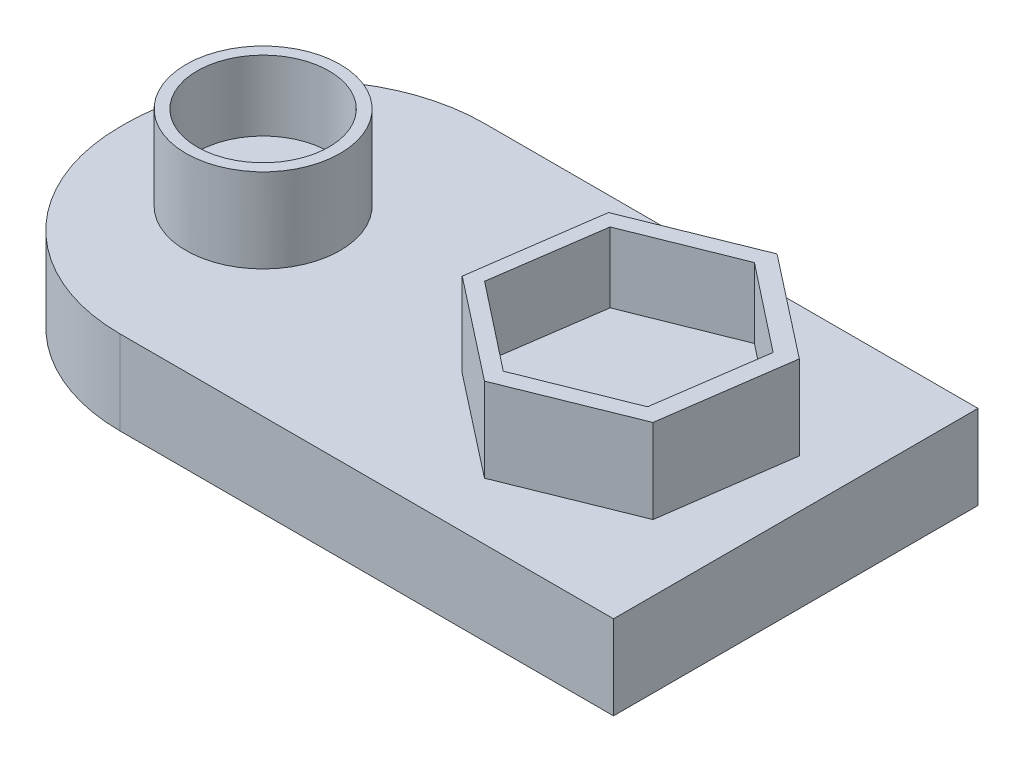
from build123d import *

# Parameters (mm, degrees)
BASE_EXTRUSION_DEPTH    = 3
ESQUISSE2_R             = 2.75
BOSS_EXTRU_1_DEPTH      = 3
ESQUISSE3_R             = 2.352309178
ENL_V_MAT_EXTRU_1_DEPTH = 2.5
ENL_V_MAT_EXTRU_2_DEPTH = 2.5


with BuildPart() as part:
    # Esquisse1 → Base-Extrusion (new body)
    with BuildSketch(Plane(origin=(0, 0, 0), x_dir=(1, 0, 0), z_dir=(0, 1, 0))):
        with BuildLine():
            Line((6.4, 0), (24, 0))
            Line((24, 0), (24, -13))
            Line((24, -13), (6.4, -13))
            ThreePointArc((6.4, -13), (1.8745166, -11.1254834), (0, -6.6))
            Line((0, -6.6), (0, -6.4))
            ThreePointArc((0, -6.4), (1.8745166, -1.8745166), (6.4, 0))
        make_face()
    extrude(amount=BASE_EXTRUSION_DEPTH)

    # Esquisse2 → Boss.-Extru.1 (add)
    with BuildSketch(Plane(origin=(0, 3, 0), x_dir=(-1, 0, 0), z_dir=(0, 1, 0))):
        with Locations(Location((-5, 6.5, 0), (0, 0, 270))):
            Circle(ESQUISSE2_R)
        Polygon((-21.63845186, 9.230732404), (-22.283216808, 4.657154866), (-18.644764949, 1.811983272), (-14.36154814, 3.540389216), (-13.716783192, 8.113966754), (-17.355235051, 10.959138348), align=None)
    extrude(amount=BOSS_EXTRU_1_DEPTH)

    # Esquisse3 → Enl_v. mat.-Extru.1 (cut)
    with BuildSketch(Plane(origin=(0, 6, 0), x_dir=(-1, 0, 0), z_dir=(0, 1, 0))):
        with Locations(Location((-5, 6.5, 0), (0, 0, 90))):
            Circle(ESQUISSE3_R)
    extrude(amount=-ENL_V_MAT_EXTRU_1_DEPTH, mode=Mode.SUBTRACT)

    # Esquisse4 → Enl_v. mat.-Extru.2 (cut)
    with BuildSketch(Plane(origin=(0, 6, 0), x_dir=(-1, 0, 0), z_dir=(0, 1, 0))):
        Polygon((-21.057310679, 8.84477447), (-21.618849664, 4.927839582), (-18.507454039, 2.483065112), (-14.834519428, 3.95522553), (-14.272980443, 7.872160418), (-17.384376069, 10.316934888), align=None)
    extrude(amount=-ENL_V_MAT_EXTRU_2_DEPTH, mode=Mode.SUBTRACT)


solid = part.part
